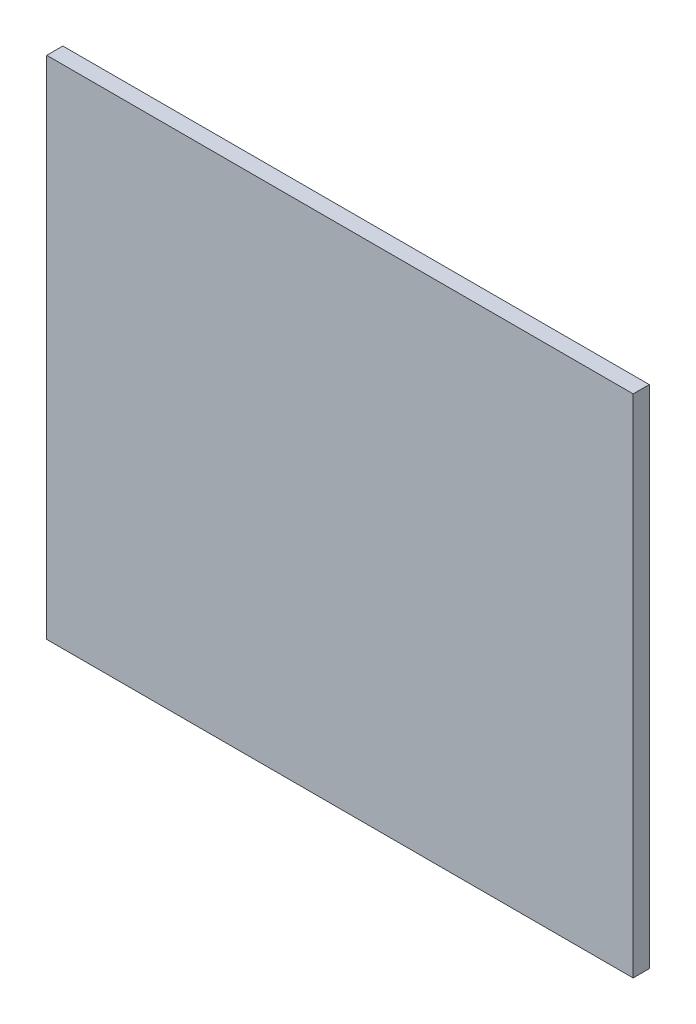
from build123d import *

# Parameters (mm, degrees)
ESQUISSE1_W        = 655
ESQUISSE1_H        = 565
BOSS_EXTRU_1_DEPTH = 18


with BuildPart() as part:
    # Esquisse1 → Boss.-Extru.1 (new body)
    with BuildSketch(Plane.XY):
        with Locations((-327.5, 282.5)):
            Rectangle(ESQUISSE1_W, ESQUISSE1_H)
    extrude(amount=BOSS_EXTRU_1_DEPTH)


solid = part.part
